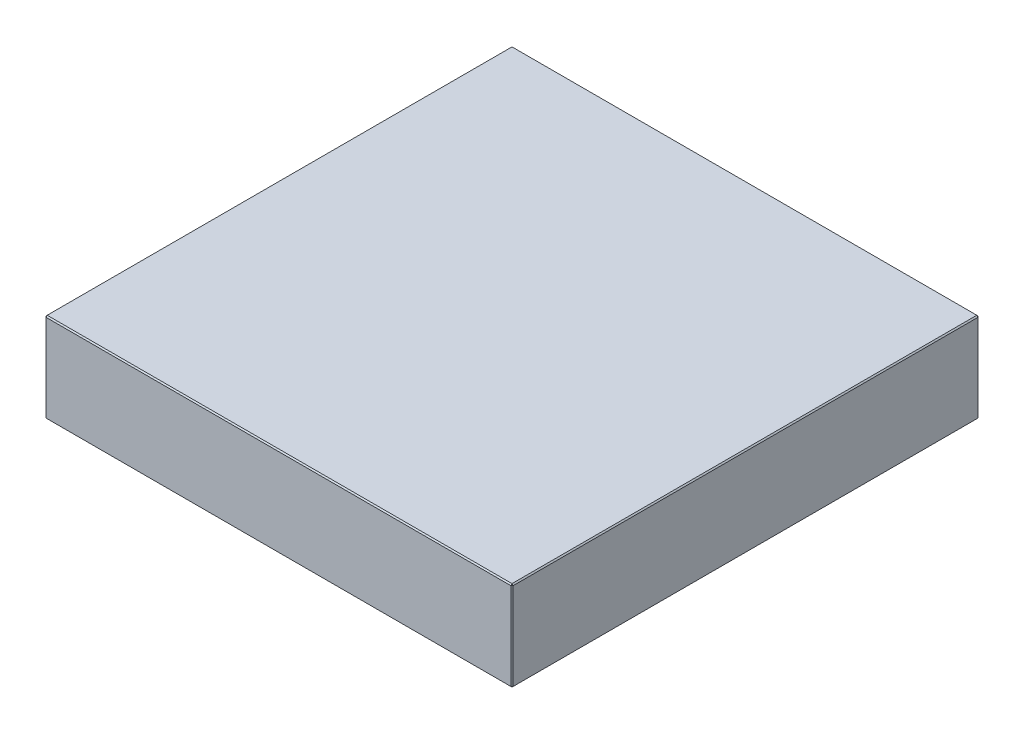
ISO-10303-21;
HEADER;
FILE_DESCRIPTION(('STEP AP214'),'2;1');
FILE_NAME('part.step','',(''),(''),'','','');
FILE_SCHEMA(('AUTOMOTIVE_DESIGN { 1 0 10303 214 1 1 1 1 }'));
ENDSEC;
DATA;
#1=APPLICATION_CONTEXT('core data for automotive mechanical design processes');
#2=APPLICATION_PROTOCOL_DEFINITION('international standard','automotive_design',2000,#1);
#3=PRODUCT_CONTEXT('',#1,'mechanical');
#4=PRODUCT('Part','Part','',(#3));
#5=PRODUCT_RELATED_PRODUCT_CATEGORY('part','',(#4));
#6=PRODUCT_DEFINITION_FORMATION('','',#4);
#7=PRODUCT_DEFINITION_CONTEXT('part definition',#1,'design');
#8=PRODUCT_DEFINITION('design','',#6,#7);
#9=PRODUCT_DEFINITION_SHAPE('','',#8);
#10=(LENGTH_UNIT() NAMED_UNIT(*) SI_UNIT(.MILLI.,.METRE.));
#11=(NAMED_UNIT(*) PLANE_ANGLE_UNIT() SI_UNIT($,.RADIAN.));
#12=(NAMED_UNIT(*) SI_UNIT($,.STERADIAN.) SOLID_ANGLE_UNIT());
#13=UNCERTAINTY_MEASURE_WITH_UNIT(LENGTH_MEASURE(1.E-05),#10,'distance_accuracy_value','');
#14=(GEOMETRIC_REPRESENTATION_CONTEXT(3) GLOBAL_UNCERTAINTY_ASSIGNED_CONTEXT((#13)) GLOBAL_UNIT_ASSIGNED_CONTEXT((#10,
#11,#12)) REPRESENTATION_CONTEXT('',''));
#15=CARTESIAN_POINT('',(0.,0.,0.));
#16=DIRECTION('',(0.,0.,1.));
#17=DIRECTION('',(1.,0.,0.));
#18=AXIS2_PLACEMENT_3D('',#15,#16,#17);
#19=CARTESIAN_POINT('',(-198.,76.,198.));
#20=DIRECTION('',(1.,0.,0.));
#21=DIRECTION('',(0.,0.,-1.));
#22=AXIS2_PLACEMENT_3D('',#19,#20,#21);
#23=PLANE('',#22);
#24=DIRECTION('',(0.,-1.,0.));
#25=VECTOR('',#24,1.);
#26=CARTESIAN_POINT('',(-198.,76.,-197.));
#27=LINE('',#26,#25);
#28=CARTESIAN_POINT('',(-198.,75.,-197.));
#29=VERTEX_POINT('',#28);
#30=CARTESIAN_POINT('',(-198.,1.,-197.));
#31=VERTEX_POINT('',#30);
#32=EDGE_CURVE('E114',#29,#31,#27,.T.);
#33=ORIENTED_EDGE('',*,*,#32,.T.);
#34=DIRECTION('',(0.,0.,1.));
#35=VECTOR('',#34,1.);
#36=CARTESIAN_POINT('',(-198.,1.,198.));
#37=LINE('',#36,#35);
#38=CARTESIAN_POINT('',(-198.,1.,197.));
#39=VERTEX_POINT('',#38);
#40=EDGE_CURVE('E110',#31,#39,#37,.T.);
#41=ORIENTED_EDGE('',*,*,#40,.T.);
#42=DIRECTION('',(0.,1.,0.));
#43=VECTOR('',#42,1.);
#44=CARTESIAN_POINT('',(-198.,76.,197.));
#45=LINE('',#44,#43);
#46=CARTESIAN_POINT('',(-198.,75.,197.));
#47=VERTEX_POINT('',#46);
#48=EDGE_CURVE('E103',#39,#47,#45,.T.);
#49=ORIENTED_EDGE('',*,*,#48,.T.);
#50=DIRECTION('',(0.,0.,-1.));
#51=VECTOR('',#50,1.);
#52=CARTESIAN_POINT('',(-198.,75.,-198.));
#53=LINE('',#52,#51);
#54=EDGE_CURVE('E107',#47,#29,#53,.T.);
#55=ORIENTED_EDGE('',*,*,#54,.T.);
#56=EDGE_LOOP('',(#33,#41,#49,#55));
#57=FACE_BOUND('',#56,.T.);
#58=ADVANCED_FACE('F15',(#57),#23,.F.);
#59=CARTESIAN_POINT('',(198.,76.,198.));
#60=DIRECTION('',(0.,0.,-1.));
#61=DIRECTION('',(-1.,0.,0.));
#62=AXIS2_PLACEMENT_3D('',#59,#60,#61);
#63=PLANE('',#62);
#64=DIRECTION('',(-1.,0.,0.));
#65=VECTOR('',#64,1.);
#66=CARTESIAN_POINT('',(-198.,75.,198.));
#67=LINE('',#66,#65);
#68=CARTESIAN_POINT('',(197.,75.,198.));
#69=VERTEX_POINT('',#68);
#70=CARTESIAN_POINT('',(-197.,75.,198.));
#71=VERTEX_POINT('',#70);
#72=EDGE_CURVE('E164',#69,#71,#67,.T.);
#73=ORIENTED_EDGE('',*,*,#72,.T.);
#74=DIRECTION('',(0.,-1.,0.));
#75=VECTOR('',#74,1.);
#76=CARTESIAN_POINT('',(-197.,76.,198.));
#77=LINE('',#76,#75);
#78=CARTESIAN_POINT('',(-197.,1.00000000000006,198.));
#79=VERTEX_POINT('',#78);
#80=EDGE_CURVE('E122',#71,#79,#77,.T.);
#81=ORIENTED_EDGE('',*,*,#80,.T.);
#82=DIRECTION('',(1.,0.,0.));
#83=VECTOR('',#82,1.);
#84=CARTESIAN_POINT('',(198.,1.00000000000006,198.));
#85=LINE('',#84,#83);
#86=CARTESIAN_POINT('',(197.,1.00000000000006,198.));
#87=VERTEX_POINT('',#86);
#88=EDGE_CURVE('E168',#79,#87,#85,.T.);
#89=ORIENTED_EDGE('',*,*,#88,.T.);
#90=DIRECTION('',(0.,1.,0.));
#91=VECTOR('',#90,1.);
#92=CARTESIAN_POINT('',(197.,76.,198.));
#93=LINE('',#92,#91);
#94=EDGE_CURVE('E166',#87,#69,#93,.T.);
#95=ORIENTED_EDGE('',*,*,#94,.T.);
#96=EDGE_LOOP('',(#73,#81,#89,#95));
#97=FACE_BOUND('',#96,.T.);
#98=ADVANCED_FACE('F275',(#97),#63,.F.);
#99=CARTESIAN_POINT('',(198.,76.,198.));
#100=DIRECTION('',(-1.,0.,0.));
#101=DIRECTION('',(0.,0.,1.));
#102=AXIS2_PLACEMENT_3D('',#99,#100,#101);
#103=PLANE('',#102);
#104=DIRECTION('',(0.,0.,-1.));
#105=VECTOR('',#104,1.);
#106=CARTESIAN_POINT('',(198.,1.00000000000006,198.));
#107=LINE('',#106,#105);
#108=CARTESIAN_POINT('',(198.,1.00000000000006,197.));
#109=VERTEX_POINT('',#108);
#110=CARTESIAN_POINT('',(198.,1.00000000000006,-197.));
#111=VERTEX_POINT('',#110);
#112=EDGE_CURVE('E159',#109,#111,#107,.T.);
#113=ORIENTED_EDGE('',*,*,#112,.T.);
#114=DIRECTION('',(0.,1.,0.));
#115=VECTOR('',#114,1.);
#116=CARTESIAN_POINT('',(198.,76.,-197.));
#117=LINE('',#116,#115);
#118=CARTESIAN_POINT('',(198.,75.,-197.));
#119=VERTEX_POINT('',#118);
#120=EDGE_CURVE('E161',#111,#119,#117,.T.);
#121=ORIENTED_EDGE('',*,*,#120,.T.);
#122=DIRECTION('',(0.,0.,1.));
#123=VECTOR('',#122,1.);
#124=CARTESIAN_POINT('',(198.,75.,198.));
#125=LINE('',#124,#123);
#126=CARTESIAN_POINT('',(198.,75.,197.));
#127=VERTEX_POINT('',#126);
#128=EDGE_CURVE('E155',#119,#127,#125,.T.);
#129=ORIENTED_EDGE('',*,*,#128,.T.);
#130=DIRECTION('',(0.,-1.,0.));
#131=VECTOR('',#130,1.);
#132=CARTESIAN_POINT('',(198.,76.,197.));
#133=LINE('',#132,#131);
#134=EDGE_CURVE('E157',#127,#109,#133,.T.);
#135=ORIENTED_EDGE('',*,*,#134,.T.);
#136=EDGE_LOOP('',(#113,#121,#129,#135));
#137=FACE_BOUND('',#136,.T.);
#138=ADVANCED_FACE('F254',(#137),#103,.F.);
#139=CARTESIAN_POINT('',(198.,76.,-198.));
#140=DIRECTION('',(0.,0.,1.));
#141=DIRECTION('',(1.,0.,0.));
#142=AXIS2_PLACEMENT_3D('',#139,#140,#141);
#143=PLANE('',#142);
#144=DIRECTION('',(0.,-1.,0.));
#145=VECTOR('',#144,1.);
#146=CARTESIAN_POINT('',(197.,76.,-198.));
#147=LINE('',#146,#145);
#148=CARTESIAN_POINT('',(197.,75.,-198.));
#149=VERTEX_POINT('',#148);
#150=CARTESIAN_POINT('',(197.,1.00000000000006,-198.));
#151=VERTEX_POINT('',#150);
#152=EDGE_CURVE('E148',#149,#151,#147,.T.);
#153=ORIENTED_EDGE('',*,*,#152,.T.);
#154=DIRECTION('',(-1.,0.,0.));
#155=VECTOR('',#154,1.);
#156=CARTESIAN_POINT('',(198.,1.00000000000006,-198.));
#157=LINE('',#156,#155);
#158=CARTESIAN_POINT('',(-197.,1.00000000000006,-198.));
#159=VERTEX_POINT('',#158);
#160=EDGE_CURVE('E153',#151,#159,#157,.T.);
#161=ORIENTED_EDGE('',*,*,#160,.T.);
#162=DIRECTION('',(0.,1.,0.));
#163=VECTOR('',#162,1.);
#164=CARTESIAN_POINT('',(-197.,76.,-198.));
#165=LINE('',#164,#163);
#166=CARTESIAN_POINT('',(-197.,75.,-198.));
#167=VERTEX_POINT('',#166);
#168=EDGE_CURVE('E150',#159,#167,#165,.T.);
#169=ORIENTED_EDGE('',*,*,#168,.T.);
#170=DIRECTION('',(1.,0.,0.));
#171=VECTOR('',#170,1.);
#172=CARTESIAN_POINT('',(198.,75.,-198.));
#173=LINE('',#172,#171);
#174=EDGE_CURVE('E146',#167,#149,#173,.T.);
#175=ORIENTED_EDGE('',*,*,#174,.T.);
#176=EDGE_LOOP('',(#153,#161,#169,#175));
#177=FACE_BOUND('',#176,.T.);
#178=ADVANCED_FACE('F284',(#177),#143,.F.);
#179=CARTESIAN_POINT('',(0.,76.,0.));
#180=DIRECTION('',(0.,1.,0.));
#181=DIRECTION('',(0.,0.,1.));
#182=AXIS2_PLACEMENT_3D('',#179,#180,#181);
#183=PLANE('',#182);
#184=DIRECTION('',(0.,0.,-1.));
#185=VECTOR('',#184,1.);
#186=CARTESIAN_POINT('',(197.,76.,-198.));
#187=LINE('',#186,#185);
#188=CARTESIAN_POINT('',(197.,76.,197.));
#189=VERTEX_POINT('',#188);
#190=CARTESIAN_POINT('',(197.,76.,-197.));
#191=VERTEX_POINT('',#190);
#192=EDGE_CURVE('E24',#189,#191,#187,.T.);
#193=ORIENTED_EDGE('',*,*,#192,.T.);
#194=DIRECTION('',(-1.,0.,0.));
#195=VECTOR('',#194,1.);
#196=CARTESIAN_POINT('',(-198.,76.,-197.));
#197=LINE('',#196,#195);
#198=CARTESIAN_POINT('',(-197.,76.,-197.));
#199=VERTEX_POINT('',#198);
#200=EDGE_CURVE('E9',#191,#199,#197,.T.);
#201=ORIENTED_EDGE('',*,*,#200,.T.);
#202=DIRECTION('',(0.,0.,1.));
#203=VECTOR('',#202,1.);
#204=CARTESIAN_POINT('',(-197.,76.,198.));
#205=LINE('',#204,#203);
#206=CARTESIAN_POINT('',(-197.,76.,197.));
#207=VERTEX_POINT('',#206);
#208=EDGE_CURVE('E180',#199,#207,#205,.T.);
#209=ORIENTED_EDGE('',*,*,#208,.T.);
#210=DIRECTION('',(1.,0.,0.));
#211=VECTOR('',#210,1.);
#212=CARTESIAN_POINT('',(198.,76.,197.));
#213=LINE('',#212,#211);
#214=EDGE_CURVE('E35',#207,#189,#213,.T.);
#215=ORIENTED_EDGE('',*,*,#214,.T.);
#216=EDGE_LOOP('',(#193,#201,#209,#215));
#217=FACE_BOUND('',#216,.T.);
#218=ADVANCED_FACE('F350',(#217),#183,.T.);
#219=CARTESIAN_POINT('',(0.,0.,0.));
#220=DIRECTION('',(0.,1.,0.));
#221=DIRECTION('',(0.,0.,1.));
#222=AXIS2_PLACEMENT_3D('',#219,#220,#221);
#223=PLANE('',#222);
#224=DIRECTION('',(0.,0.,1.));
#225=VECTOR('',#224,1.);
#226=CARTESIAN_POINT('',(197.,0.,0.));
#227=LINE('',#226,#225);
#228=CARTESIAN_POINT('',(197.,0.,-197.));
#229=VERTEX_POINT('',#228);
#230=CARTESIAN_POINT('',(197.,0.,197.));
#231=VERTEX_POINT('',#230);
#232=EDGE_CURVE('E171',#229,#231,#227,.T.);
#233=ORIENTED_EDGE('',*,*,#232,.T.);
#234=DIRECTION('',(-1.,0.,0.));
#235=VECTOR('',#234,1.);
#236=CARTESIAN_POINT('',(0.,0.,197.));
#237=LINE('',#236,#235);
#238=CARTESIAN_POINT('',(-197.,0.,197.));
#239=VERTEX_POINT('',#238);
#240=EDGE_CURVE('E177',#231,#239,#237,.T.);
#241=ORIENTED_EDGE('',*,*,#240,.T.);
#242=DIRECTION('',(0.,0.,-1.));
#243=VECTOR('',#242,1.);
#244=CARTESIAN_POINT('',(-197.,0.,0.));
#245=LINE('',#244,#243);
#246=CARTESIAN_POINT('',(-197.,0.,-197.));
#247=VERTEX_POINT('',#246);
#248=EDGE_CURVE('E175',#239,#247,#245,.T.);
#249=ORIENTED_EDGE('',*,*,#248,.T.);
#250=DIRECTION('',(1.,0.,0.));
#251=VECTOR('',#250,1.);
#252=CARTESIAN_POINT('',(0.,0.,-197.));
#253=LINE('',#252,#251);
#254=EDGE_CURVE('E173',#247,#229,#253,.T.);
#255=ORIENTED_EDGE('',*,*,#254,.T.);
#256=EDGE_LOOP('',(#233,#241,#249,#255));
#257=FACE_BOUND('',#256,.T.);
#258=ADVANCED_FACE('F246',(#257),#223,.F.);
#259=CARTESIAN_POINT('',(198.,76.,197.));
#260=DIRECTION('',(-0.707106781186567,0.,-0.707106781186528));
#261=DIRECTION('',(0.,-1.,0.));
#262=AXIS2_PLACEMENT_3D('',#259,#260,#261);
#263=PLANE('',#262);
#264=DIRECTION('',(-0.707106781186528,0.,0.707106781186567));
#265=VECTOR('',#264,1.);
#266=CARTESIAN_POINT('',(197.,75.,198.));
#267=LINE('',#266,#265);
#268=EDGE_CURVE('E19',#69,#127,#267,.F.);
#269=ORIENTED_EDGE('',*,*,#268,.F.);
#270=ORIENTED_EDGE('',*,*,#94,.F.);
#271=DIRECTION('',(0.707106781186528,0.,-0.707106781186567));
#272=VECTOR('',#271,1.);
#273=CARTESIAN_POINT('',(197.,1.00000000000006,198.));
#274=LINE('',#273,#272);
#275=EDGE_CURVE('E142',#109,#87,#274,.F.);
#276=ORIENTED_EDGE('',*,*,#275,.F.);
#277=ORIENTED_EDGE('',*,*,#134,.F.);
#278=EDGE_LOOP('',(#269,#270,#276,#277));
#279=FACE_BOUND('',#278,.T.);
#280=ADVANCED_FACE('F17',(#279),#263,.F.);
#281=CARTESIAN_POINT('',(197.,75.,198.));
#282=DIRECTION('',(0.577350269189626,0.577350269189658,0.577350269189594));
#283=DIRECTION('',(-0.707106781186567,0.707106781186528,0.));
#284=AXIS2_PLACEMENT_3D('',#281,#282,#283);
#285=PLANE('',#284);
#286=DIRECTION('',(0.,-0.707106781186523,0.707106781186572));
#287=VECTOR('',#286,1.);
#288=CARTESIAN_POINT('',(197.,75.,198.));
#289=LINE('',#288,#287);
#290=EDGE_CURVE('E226',#69,#189,#289,.F.);
#291=ORIENTED_EDGE('',*,*,#290,.F.);
#292=ORIENTED_EDGE('',*,*,#268,.T.);
#293=DIRECTION('',(-0.707106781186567,0.707106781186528,0.));
#294=VECTOR('',#293,1.);
#295=CARTESIAN_POINT('',(197.5,75.5,197.));
#296=LINE('',#295,#294);
#297=EDGE_CURVE('E228',#189,#127,#296,.F.);
#298=ORIENTED_EDGE('',*,*,#297,.F.);
#299=EDGE_LOOP('',(#291,#292,#298));
#300=FACE_BOUND('',#299,.T.);
#301=ADVANCED_FACE('F270',(#300),#285,.T.);
#302=CARTESIAN_POINT('',(197.,1.00000000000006,198.));
#303=DIRECTION('',(0.577350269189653,-0.577350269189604,0.57735026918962));
#304=DIRECTION('',(0.707106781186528,0.,-0.707106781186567));
#305=AXIS2_PLACEMENT_3D('',#302,#303,#304);
#306=PLANE('',#305);
#307=DIRECTION('',(-0.707106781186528,-0.707106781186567,0.));
#308=VECTOR('',#307,1.);
#309=CARTESIAN_POINT('',(197.5,0.500000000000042,197.));
#310=LINE('',#309,#308);
#311=EDGE_CURVE('E220',#109,#231,#310,.T.);
#312=ORIENTED_EDGE('',*,*,#311,.F.);
#313=ORIENTED_EDGE('',*,*,#275,.T.);
#314=DIRECTION('',(0.,0.707106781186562,0.707106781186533));
#315=VECTOR('',#314,1.);
#316=CARTESIAN_POINT('',(197.,1.00000000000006,198.));
#317=LINE('',#316,#315);
#318=EDGE_CURVE('E223',#231,#87,#317,.T.);
#319=ORIENTED_EDGE('',*,*,#318,.F.);
#320=EDGE_LOOP('',(#312,#313,#319));
#321=FACE_BOUND('',#320,.T.);
#322=ADVANCED_FACE('F235',(#321),#306,.T.);
#323=CARTESIAN_POINT('',(197.,76.,0.));
#324=DIRECTION('',(0.707106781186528,0.707106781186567,0.));
#325=DIRECTION('',(0.,0.,1.));
#326=AXIS2_PLACEMENT_3D('',#323,#324,#325);
#327=PLANE('',#326);
#328=ORIENTED_EDGE('',*,*,#297,.T.);
#329=ORIENTED_EDGE('',*,*,#128,.F.);
#330=DIRECTION('',(0.707106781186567,-0.707106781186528,0.));
#331=VECTOR('',#330,1.);
#332=CARTESIAN_POINT('',(198.,75.,-197.));
#333=LINE('',#332,#331);
#334=EDGE_CURVE('E215',#191,#119,#333,.T.);
#335=ORIENTED_EDGE('',*,*,#334,.F.);
#336=ORIENTED_EDGE('',*,*,#192,.F.);
#337=EDGE_LOOP('',(#328,#329,#335,#336));
#338=FACE_BOUND('',#337,.T.);
#339=ADVANCED_FACE('F265',(#338),#327,.T.);
#340=CARTESIAN_POINT('',(0.,76.,197.));
#341=DIRECTION('',(0.,0.707106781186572,0.707106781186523));
#342=DIRECTION('',(-1.,0.,0.));
#343=AXIS2_PLACEMENT_3D('',#340,#341,#342);
#344=PLANE('',#343);
#345=ORIENTED_EDGE('',*,*,#290,.T.);
#346=ORIENTED_EDGE('',*,*,#214,.F.);
#347=DIRECTION('',(0.,0.707106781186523,-0.707106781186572));
#348=VECTOR('',#347,1.);
#349=CARTESIAN_POINT('',(-197.,75.5,197.5));
#350=LINE('',#349,#348);
#351=EDGE_CURVE('E126',#71,#207,#350,.T.);
#352=ORIENTED_EDGE('',*,*,#351,.F.);
#353=ORIENTED_EDGE('',*,*,#72,.F.);
#354=EDGE_LOOP('',(#345,#346,#352,#353));
#355=FACE_BOUND('',#354,.T.);
#356=ADVANCED_FACE('F273',(#355),#344,.T.);
#357=CARTESIAN_POINT('',(-197.,76.,198.));
#358=DIRECTION('',(0.707106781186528,0.,-0.707106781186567));
#359=DIRECTION('',(0.,-1.,0.));
#360=AXIS2_PLACEMENT_3D('',#357,#358,#359);
#361=PLANE('',#360);
#362=DIRECTION('',(0.707106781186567,0.,0.707106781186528));
#363=VECTOR('',#362,1.);
#364=CARTESIAN_POINT('',(-197.,1.00000000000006,198.));
#365=LINE('',#364,#363);
#366=EDGE_CURVE('E127',#79,#39,#365,.F.);
#367=ORIENTED_EDGE('',*,*,#366,.F.);
#368=ORIENTED_EDGE('',*,*,#80,.F.);
#369=DIRECTION('',(-0.707106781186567,0.,-0.707106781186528));
#370=VECTOR('',#369,1.);
#371=CARTESIAN_POINT('',(-198.,75.,197.));
#372=LINE('',#371,#370);
#373=EDGE_CURVE('E118',#47,#71,#372,.F.);
#374=ORIENTED_EDGE('',*,*,#373,.F.);
#375=ORIENTED_EDGE('',*,*,#48,.F.);
#376=EDGE_LOOP('',(#367,#368,#374,#375));
#377=FACE_BOUND('',#376,.T.);
#378=ADVANCED_FACE('F120',(#377),#361,.F.);
#379=CARTESIAN_POINT('',(198.,1.00000000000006,198.));
#380=DIRECTION('',(0.,0.707106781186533,-0.707106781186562));
#381=DIRECTION('',(1.,0.,0.));
#382=AXIS2_PLACEMENT_3D('',#379,#380,#381);
#383=PLANE('',#382);
#384=ORIENTED_EDGE('',*,*,#318,.T.);
#385=ORIENTED_EDGE('',*,*,#88,.F.);
#386=DIRECTION('',(0.,-0.707106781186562,-0.707106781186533));
#387=VECTOR('',#386,1.);
#388=CARTESIAN_POINT('',(-197.,1.00000000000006,198.));
#389=LINE('',#388,#387);
#390=EDGE_CURVE('E211',#239,#79,#389,.F.);
#391=ORIENTED_EDGE('',*,*,#390,.F.);
#392=ORIENTED_EDGE('',*,*,#240,.F.);
#393=EDGE_LOOP('',(#384,#385,#391,#392));
#394=FACE_BOUND('',#393,.T.);
#395=ADVANCED_FACE('F243',(#394),#383,.F.);
#396=CARTESIAN_POINT('',(198.,1.00000000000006,198.));
#397=DIRECTION('',(-0.707106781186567,0.707106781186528,0.));
#398=DIRECTION('',(0.,0.,-1.));
#399=AXIS2_PLACEMENT_3D('',#396,#397,#398);
#400=PLANE('',#399);
#401=ORIENTED_EDGE('',*,*,#311,.T.);
#402=ORIENTED_EDGE('',*,*,#232,.F.);
#403=DIRECTION('',(0.707106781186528,0.707106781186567,0.));
#404=VECTOR('',#403,1.);
#405=CARTESIAN_POINT('',(197.5,0.500000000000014,-197.));
#406=LINE('',#405,#404);
#407=EDGE_CURVE('E208',#111,#229,#406,.F.);
#408=ORIENTED_EDGE('',*,*,#407,.F.);
#409=ORIENTED_EDGE('',*,*,#112,.F.);
#410=EDGE_LOOP('',(#401,#402,#408,#409));
#411=FACE_BOUND('',#410,.T.);
#412=ADVANCED_FACE('F251',(#411),#400,.F.);
#413=CARTESIAN_POINT('',(197.,76.,-198.));
#414=DIRECTION('',(-0.707106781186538,0.,0.707106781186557));
#415=DIRECTION('',(0.,-1.,0.));
#416=AXIS2_PLACEMENT_3D('',#413,#414,#415);
#417=PLANE('',#416);
#418=DIRECTION('',(0.707106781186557,0.,0.707106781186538));
#419=VECTOR('',#418,1.);
#420=CARTESIAN_POINT('',(198.,75.,-197.));
#421=LINE('',#420,#419);
#422=EDGE_CURVE('E217',#119,#149,#421,.F.);
#423=ORIENTED_EDGE('',*,*,#422,.F.);
#424=ORIENTED_EDGE('',*,*,#120,.F.);
#425=DIRECTION('',(-0.707106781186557,0.,-0.707106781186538));
#426=VECTOR('',#425,1.);
#427=CARTESIAN_POINT('',(197.,1.00000000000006,-198.));
#428=LINE('',#427,#426);
#429=EDGE_CURVE('E205',#151,#111,#428,.F.);
#430=ORIENTED_EDGE('',*,*,#429,.F.);
#431=ORIENTED_EDGE('',*,*,#152,.F.);
#432=EDGE_LOOP('',(#423,#424,#430,#431));
#433=FACE_BOUND('',#432,.T.);
#434=ADVANCED_FACE('F258',(#433),#417,.F.);
#435=CARTESIAN_POINT('',(198.,75.,-197.));
#436=DIRECTION('',(0.577350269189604,0.577350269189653,-0.57735026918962));
#437=DIRECTION('',(0.,0.707106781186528,0.707106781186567));
#438=AXIS2_PLACEMENT_3D('',#435,#436,#437);
#439=PLANE('',#438);
#440=ORIENTED_EDGE('',*,*,#334,.T.);
#441=ORIENTED_EDGE('',*,*,#422,.T.);
#442=DIRECTION('',(0.,0.707106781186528,0.707106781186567));
#443=VECTOR('',#442,1.);
#444=CARTESIAN_POINT('',(197.,75.5,-197.5));
#445=LINE('',#444,#443);
#446=EDGE_CURVE('E134',#191,#149,#445,.F.);
#447=ORIENTED_EDGE('',*,*,#446,.F.);
#448=EDGE_LOOP('',(#440,#441,#447));
#449=FACE_BOUND('',#448,.T.);
#450=ADVANCED_FACE('F325',(#449),#439,.T.);
#451=CARTESIAN_POINT('',(-198.,75.,197.));
#452=DIRECTION('',(-0.577350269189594,0.577350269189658,0.577350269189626));
#453=DIRECTION('',(0.,-0.707106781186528,0.707106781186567));
#454=AXIS2_PLACEMENT_3D('',#451,#452,#453);
#455=PLANE('',#454);
#456=ORIENTED_EDGE('',*,*,#373,.T.);
#457=ORIENTED_EDGE('',*,*,#351,.T.);
#458=DIRECTION('',(-0.707106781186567,-0.707106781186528,0.));
#459=VECTOR('',#458,1.);
#460=CARTESIAN_POINT('',(-198.,75.,197.));
#461=LINE('',#460,#459);
#462=EDGE_CURVE('E130',#47,#207,#461,.F.);
#463=ORIENTED_EDGE('',*,*,#462,.F.);
#464=EDGE_LOOP('',(#456,#457,#463));
#465=FACE_BOUND('',#464,.T.);
#466=ADVANCED_FACE('F131',(#465),#455,.T.);
#467=CARTESIAN_POINT('',(-197.,1.00000000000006,198.));
#468=DIRECTION('',(-0.577350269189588,-0.577350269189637,0.577350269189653));
#469=DIRECTION('',(0.,-0.707106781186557,-0.707106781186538));
#470=AXIS2_PLACEMENT_3D('',#467,#468,#469);
#471=PLANE('',#470);
#472=ORIENTED_EDGE('',*,*,#390,.T.);
#473=ORIENTED_EDGE('',*,*,#366,.T.);
#474=DIRECTION('',(-0.707106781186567,0.707106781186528,0.));
#475=VECTOR('',#474,1.);
#476=CARTESIAN_POINT('',(-197.5,0.500000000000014,197.));
#477=LINE('',#476,#475);
#478=EDGE_CURVE('E135',#239,#39,#477,.T.);
#479=ORIENTED_EDGE('',*,*,#478,.F.);
#480=EDGE_LOOP('',(#472,#473,#479));
#481=FACE_BOUND('',#480,.T.);
#482=ADVANCED_FACE('F318',(#481),#471,.T.);
#483=CARTESIAN_POINT('',(197.,1.00000000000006,-198.));
#484=DIRECTION('',(0.577350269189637,-0.577350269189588,-0.577350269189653));
#485=DIRECTION('',(-0.707106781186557,0.,-0.707106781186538));
#486=AXIS2_PLACEMENT_3D('',#483,#484,#485);
#487=PLANE('',#486);
#488=ORIENTED_EDGE('',*,*,#429,.T.);
#489=ORIENTED_EDGE('',*,*,#407,.T.);
#490=DIRECTION('',(0.,-0.707106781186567,0.707106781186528));
#491=VECTOR('',#490,1.);
#492=CARTESIAN_POINT('',(197.,1.00000000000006,-198.));
#493=LINE('',#492,#491);
#494=EDGE_CURVE('E198',#151,#229,#493,.T.);
#495=ORIENTED_EDGE('',*,*,#494,.F.);
#496=EDGE_LOOP('',(#488,#489,#495));
#497=FACE_BOUND('',#496,.T.);
#498=ADVANCED_FACE('F314',(#497),#487,.T.);
#499=CARTESIAN_POINT('',(0.,76.,-197.));
#500=DIRECTION('',(0.,0.707106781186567,-0.707106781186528));
#501=DIRECTION('',(1.,0.,0.));
#502=AXIS2_PLACEMENT_3D('',#499,#500,#501);
#503=PLANE('',#502);
#504=ORIENTED_EDGE('',*,*,#446,.T.);
#505=ORIENTED_EDGE('',*,*,#174,.F.);
#506=DIRECTION('',(0.,-0.707106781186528,-0.707106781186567));
#507=VECTOR('',#506,1.);
#508=CARTESIAN_POINT('',(-197.,75.,-198.));
#509=LINE('',#508,#507);
#510=EDGE_CURVE('E195',#199,#167,#509,.T.);
#511=ORIENTED_EDGE('',*,*,#510,.F.);
#512=ORIENTED_EDGE('',*,*,#200,.F.);
#513=EDGE_LOOP('',(#504,#505,#511,#512));
#514=FACE_BOUND('',#513,.T.);
#515=ADVANCED_FACE('F311',(#514),#503,.T.);
#516=CARTESIAN_POINT('',(-197.,76.,0.));
#517=DIRECTION('',(-0.707106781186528,0.707106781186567,0.));
#518=DIRECTION('',(0.,0.,-1.));
#519=AXIS2_PLACEMENT_3D('',#516,#517,#518);
#520=PLANE('',#519);
#521=ORIENTED_EDGE('',*,*,#462,.T.);
#522=ORIENTED_EDGE('',*,*,#208,.F.);
#523=DIRECTION('',(0.707106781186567,0.707106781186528,0.));
#524=VECTOR('',#523,1.);
#525=CARTESIAN_POINT('',(-197.5,75.5,-197.));
#526=LINE('',#525,#524);
#527=EDGE_CURVE('E138',#29,#199,#526,.T.);
#528=ORIENTED_EDGE('',*,*,#527,.F.);
#529=ORIENTED_EDGE('',*,*,#54,.F.);
#530=EDGE_LOOP('',(#521,#522,#528,#529));
#531=FACE_BOUND('',#530,.T.);
#532=ADVANCED_FACE('F137',(#531),#520,.T.);
#533=CARTESIAN_POINT('',(-198.,1.,198.));
#534=DIRECTION('',(0.707106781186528,0.707106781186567,0.));
#535=DIRECTION('',(0.,0.,1.));
#536=AXIS2_PLACEMENT_3D('',#533,#534,#535);
#537=PLANE('',#536);
#538=ORIENTED_EDGE('',*,*,#478,.T.);
#539=ORIENTED_EDGE('',*,*,#40,.F.);
#540=DIRECTION('',(0.707106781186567,-0.707106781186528,0.));
#541=VECTOR('',#540,1.);
#542=CARTESIAN_POINT('',(-198.,1.,-197.));
#543=LINE('',#542,#541);
#544=EDGE_CURVE('E191',#247,#31,#543,.F.);
#545=ORIENTED_EDGE('',*,*,#544,.F.);
#546=ORIENTED_EDGE('',*,*,#248,.F.);
#547=EDGE_LOOP('',(#538,#539,#545,#546));
#548=FACE_BOUND('',#547,.T.);
#549=ADVANCED_FACE('F304',(#548),#537,.F.);
#550=CARTESIAN_POINT('',(198.,1.00000000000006,-198.));
#551=DIRECTION('',(0.,0.707106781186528,0.707106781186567));
#552=DIRECTION('',(-1.,0.,0.));
#553=AXIS2_PLACEMENT_3D('',#550,#551,#552);
#554=PLANE('',#553);
#555=ORIENTED_EDGE('',*,*,#494,.T.);
#556=ORIENTED_EDGE('',*,*,#254,.F.);
#557=DIRECTION('',(0.,0.707106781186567,-0.707106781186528));
#558=VECTOR('',#557,1.);
#559=CARTESIAN_POINT('',(-197.,0.500000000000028,-197.5));
#560=LINE('',#559,#558);
#561=EDGE_CURVE('E188',#159,#247,#560,.F.);
#562=ORIENTED_EDGE('',*,*,#561,.F.);
#563=ORIENTED_EDGE('',*,*,#160,.F.);
#564=EDGE_LOOP('',(#555,#556,#562,#563));
#565=FACE_BOUND('',#564,.T.);
#566=ADVANCED_FACE('F300',(#565),#554,.F.);
#567=CARTESIAN_POINT('',(-197.,75.,-198.));
#568=DIRECTION('',(-0.577350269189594,0.577350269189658,-0.577350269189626));
#569=DIRECTION('',(0.,0.707106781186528,0.707106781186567));
#570=AXIS2_PLACEMENT_3D('',#567,#568,#569);
#571=PLANE('',#570);
#572=ORIENTED_EDGE('',*,*,#527,.T.);
#573=ORIENTED_EDGE('',*,*,#510,.T.);
#574=DIRECTION('',(0.707106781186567,0.,-0.707106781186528));
#575=VECTOR('',#574,1.);
#576=CARTESIAN_POINT('',(-197.,75.,-198.));
#577=LINE('',#576,#575);
#578=EDGE_CURVE('E186',#29,#167,#577,.T.);
#579=ORIENTED_EDGE('',*,*,#578,.F.);
#580=EDGE_LOOP('',(#572,#573,#579));
#581=FACE_BOUND('',#580,.T.);
#582=ADVANCED_FACE('F296',(#581),#571,.T.);
#583=CARTESIAN_POINT('',(-198.,1.,-197.));
#584=DIRECTION('',(-0.577350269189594,-0.577350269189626,-0.577350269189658));
#585=DIRECTION('',(0.,0.707106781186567,-0.707106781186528));
#586=AXIS2_PLACEMENT_3D('',#583,#584,#585);
#587=PLANE('',#586);
#588=ORIENTED_EDGE('',*,*,#561,.T.);
#589=ORIENTED_EDGE('',*,*,#544,.T.);
#590=DIRECTION('',(-0.707106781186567,0.,0.707106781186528));
#591=VECTOR('',#590,1.);
#592=CARTESIAN_POINT('',(-198.,1.,-197.));
#593=LINE('',#592,#591);
#594=EDGE_CURVE('E184',#159,#31,#593,.T.);
#595=ORIENTED_EDGE('',*,*,#594,.F.);
#596=EDGE_LOOP('',(#588,#589,#595));
#597=FACE_BOUND('',#596,.T.);
#598=ADVANCED_FACE('F292',(#597),#587,.T.);
#599=CARTESIAN_POINT('',(-198.,76.,-197.));
#600=DIRECTION('',(0.707106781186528,0.,0.707106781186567));
#601=DIRECTION('',(0.,-1.,0.));
#602=AXIS2_PLACEMENT_3D('',#599,#600,#601);
#603=PLANE('',#602);
#604=ORIENTED_EDGE('',*,*,#578,.T.);
#605=ORIENTED_EDGE('',*,*,#168,.F.);
#606=ORIENTED_EDGE('',*,*,#594,.T.);
#607=ORIENTED_EDGE('',*,*,#32,.F.);
#608=EDGE_LOOP('',(#604,#605,#606,#607));
#609=FACE_BOUND('',#608,.T.);
#610=ADVANCED_FACE('F289',(#609),#603,.F.);
#611=CLOSED_SHELL('',(#58,#98,#138,#178,#218,#258,#280,#301,#322,#339,#356,#378,#395,#412,#434,
#450,#466,#482,#498,#515,#532,#549,#566,#582,#598,#610));
#612=MANIFOLD_SOLID_BREP('B1',#611);
#613=ADVANCED_BREP_SHAPE_REPRESENTATION('',(#18,#612),#14);
#614=SHAPE_DEFINITION_REPRESENTATION(#9,#613);
ENDSEC;
END-ISO-10303-21;
